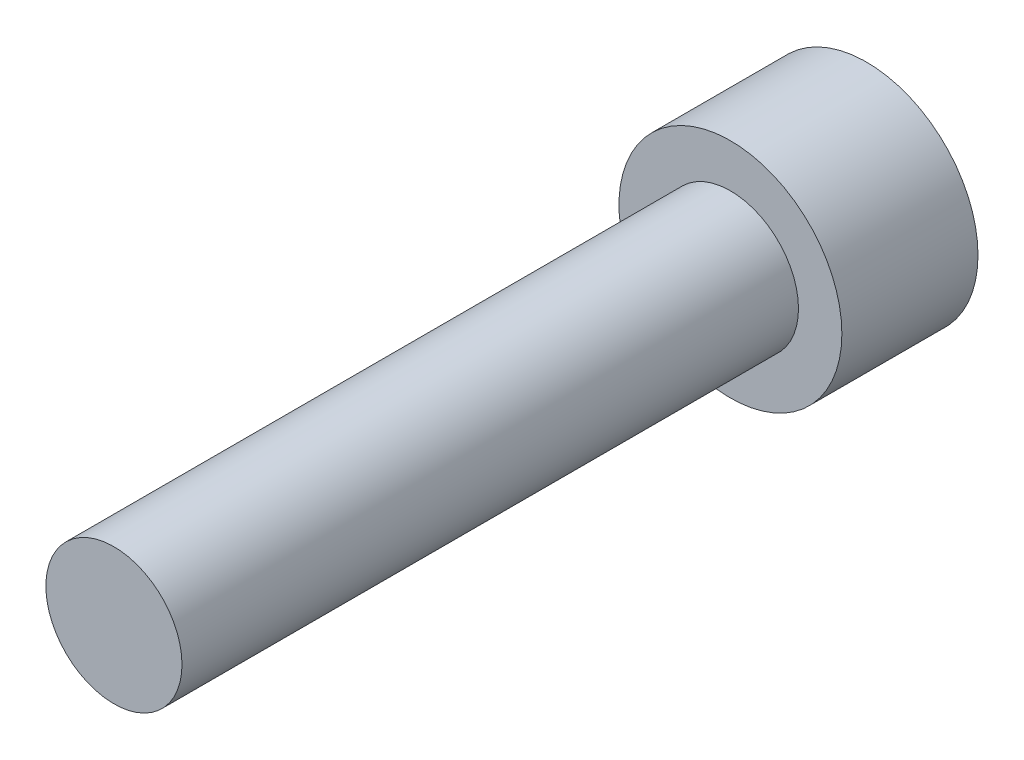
ISO-10303-21;
HEADER;
FILE_DESCRIPTION(('STEP AP214'),'2;1');
FILE_NAME('part.step','',(''),(''),'','','');
FILE_SCHEMA(('AUTOMOTIVE_DESIGN { 1 0 10303 214 1 1 1 1 }'));
ENDSEC;
DATA;
#1=APPLICATION_CONTEXT('core data for automotive mechanical design processes');
#2=APPLICATION_PROTOCOL_DEFINITION('international standard','automotive_design',2000,#1);
#3=PRODUCT_CONTEXT('',#1,'mechanical');
#4=PRODUCT('Part','Part','',(#3));
#5=PRODUCT_RELATED_PRODUCT_CATEGORY('part','',(#4));
#6=PRODUCT_DEFINITION_FORMATION('','',#4);
#7=PRODUCT_DEFINITION_CONTEXT('part definition',#1,'design');
#8=PRODUCT_DEFINITION('design','',#6,#7);
#9=PRODUCT_DEFINITION_SHAPE('','',#8);
#10=(LENGTH_UNIT() NAMED_UNIT(*) SI_UNIT(.MILLI.,.METRE.));
#11=(NAMED_UNIT(*) PLANE_ANGLE_UNIT() SI_UNIT($,.RADIAN.));
#12=(NAMED_UNIT(*) SI_UNIT($,.STERADIAN.) SOLID_ANGLE_UNIT());
#13=UNCERTAINTY_MEASURE_WITH_UNIT(LENGTH_MEASURE(1.E-05),#10,'distance_accuracy_value','');
#14=(GEOMETRIC_REPRESENTATION_CONTEXT(3) GLOBAL_UNCERTAINTY_ASSIGNED_CONTEXT((#13)) GLOBAL_UNIT_ASSIGNED_CONTEXT((#10,
#11,#12)) REPRESENTATION_CONTEXT('',''));
#15=CARTESIAN_POINT('',(0.,0.,0.));
#16=DIRECTION('',(0.,0.,1.));
#17=DIRECTION('',(1.,0.,0.));
#18=AXIS2_PLACEMENT_3D('',#15,#16,#17);
#19=CARTESIAN_POINT('',(0.,-2.8702,-3.5052));
#20=DIRECTION('',(0.,0.,-1.));
#21=DIRECTION('',(-1.,0.,0.));
#22=AXIS2_PLACEMENT_3D('',#19,#20,#21);
#23=PLANE('',#22);
#24=DIRECTION('',(0.866025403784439,-0.5,0.));
#25=VECTOR('',#24,1.);
#26=CARTESIAN_POINT('',(0.,1.5984519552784,-3.5052));
#27=LINE('',#26,#25);
#28=CARTESIAN_POINT('',(0.,1.5984519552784,-3.5052));
#29=VERTEX_POINT('',#28);
#30=CARTESIAN_POINT('',(1.3843,0.799225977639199,-3.5052));
#31=VERTEX_POINT('',#30);
#32=EDGE_CURVE('E46',#29,#31,#27,.T.);
#33=ORIENTED_EDGE('',*,*,#32,.F.);
#34=DIRECTION('',(0.866025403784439,0.5,0.));
#35=VECTOR('',#34,1.);
#36=CARTESIAN_POINT('',(-1.3843,0.7992259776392,-3.5052));
#37=LINE('',#36,#35);
#38=CARTESIAN_POINT('',(-1.3843,0.7992259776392,-3.5052));
#39=VERTEX_POINT('',#38);
#40=EDGE_CURVE('E129',#39,#29,#37,.T.);
#41=ORIENTED_EDGE('',*,*,#40,.F.);
#42=DIRECTION('',(0.,1.,0.));
#43=VECTOR('',#42,1.);
#44=CARTESIAN_POINT('',(-1.3843,-0.799225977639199,-3.5052));
#45=LINE('',#44,#43);
#46=CARTESIAN_POINT('',(-1.3843,-0.799225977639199,-3.5052));
#47=VERTEX_POINT('',#46);
#48=EDGE_CURVE('E127',#47,#39,#45,.T.);
#49=ORIENTED_EDGE('',*,*,#48,.F.);
#50=DIRECTION('',(-0.866025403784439,0.5,0.));
#51=VECTOR('',#50,1.);
#52=CARTESIAN_POINT('',(0.,-1.5984519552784,-3.5052));
#53=LINE('',#52,#51);
#54=CARTESIAN_POINT('',(0.,-1.5984519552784,-3.5052));
#55=VERTEX_POINT('',#54);
#56=EDGE_CURVE('E94',#55,#47,#53,.T.);
#57=ORIENTED_EDGE('',*,*,#56,.F.);
#58=DIRECTION('',(-0.866025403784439,-0.5,0.));
#59=VECTOR('',#58,1.);
#60=CARTESIAN_POINT('',(1.3843,-0.799225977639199,-3.5052));
#61=LINE('',#60,#59);
#62=CARTESIAN_POINT('',(1.3843,-0.799225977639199,-3.5052));
#63=VERTEX_POINT('',#62);
#64=EDGE_CURVE('E123',#63,#55,#61,.T.);
#65=ORIENTED_EDGE('',*,*,#64,.F.);
#66=DIRECTION('',(0.,-1.,0.));
#67=VECTOR('',#66,1.);
#68=CARTESIAN_POINT('',(1.3843,0.799225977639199,-3.5052));
#69=LINE('',#68,#67);
#70=EDGE_CURVE('E120',#31,#63,#69,.T.);
#71=ORIENTED_EDGE('',*,*,#70,.F.);
#72=EDGE_LOOP('',(#33,#41,#49,#57,#65,#71));
#73=FACE_BOUND('',#72,.T.);
#74=CARTESIAN_POINT('',(0.,0.,-3.5052));
#75=DIRECTION('',(0.,0.,1.));
#76=DIRECTION('',(1.,0.,0.));
#77=AXIS2_PLACEMENT_3D('',#74,#75,#76);
#78=CIRCLE('',#77,2.8702);
#79=CARTESIAN_POINT('',(2.8702,0.,-3.5052));
#80=VERTEX_POINT('',#79);
#81=EDGE_CURVE('E11',#80,#80,#78,.T.);
#82=ORIENTED_EDGE('',*,*,#81,.F.);
#83=EDGE_LOOP('',(#82));
#84=FACE_BOUND('',#83,.T.);
#85=ADVANCED_FACE('F32',(#73,#84),#23,.T.);
#86=CARTESIAN_POINT('',(0.,0.,15.875));
#87=DIRECTION('',(0.,0.,1.));
#88=DIRECTION('',(1.,0.,0.));
#89=AXIS2_PLACEMENT_3D('',#86,#87,#88);
#90=CYLINDRICAL_SURFACE('',#89,2.8702);
#91=ORIENTED_EDGE('',*,*,#81,.T.);
#92=EDGE_LOOP('',(#91));
#93=FACE_BOUND('',#92,.T.);
#94=CARTESIAN_POINT('',(0.,0.,0.));
#95=DIRECTION('',(0.,0.,1.));
#96=DIRECTION('',(1.,0.,0.));
#97=AXIS2_PLACEMENT_3D('',#94,#95,#96);
#98=CIRCLE('',#97,2.8702);
#99=CARTESIAN_POINT('',(2.8702,0.,0.));
#100=VERTEX_POINT('',#99);
#101=EDGE_CURVE('E39',#100,#100,#98,.T.);
#102=ORIENTED_EDGE('',*,*,#101,.F.);
#103=EDGE_LOOP('',(#102));
#104=FACE_BOUND('',#103,.T.);
#105=ADVANCED_FACE('F149',(#93,#104),#90,.T.);
#106=CARTESIAN_POINT('',(0.,-1.7526,0.));
#107=DIRECTION('',(0.,0.,1.));
#108=DIRECTION('',(1.,0.,0.));
#109=AXIS2_PLACEMENT_3D('',#106,#107,#108);
#110=PLANE('',#109);
#111=ORIENTED_EDGE('',*,*,#101,.T.);
#112=EDGE_LOOP('',(#111));
#113=FACE_BOUND('',#112,.T.);
#114=CARTESIAN_POINT('',(0.,0.,0.));
#115=DIRECTION('',(0.,0.,1.));
#116=DIRECTION('',(1.,0.,0.));
#117=AXIS2_PLACEMENT_3D('',#114,#115,#116);
#118=CIRCLE('',#117,1.7526);
#119=CARTESIAN_POINT('',(1.7526,0.,0.));
#120=VERTEX_POINT('',#119);
#121=EDGE_CURVE('E141',#120,#120,#118,.T.);
#122=ORIENTED_EDGE('',*,*,#121,.F.);
#123=EDGE_LOOP('',(#122));
#124=FACE_BOUND('',#123,.T.);
#125=ADVANCED_FACE('F146',(#113,#124),#110,.T.);
#126=CARTESIAN_POINT('',(0.,0.,15.875));
#127=DIRECTION('',(0.,0.,1.));
#128=DIRECTION('',(1.,0.,0.));
#129=AXIS2_PLACEMENT_3D('',#126,#127,#128);
#130=CYLINDRICAL_SURFACE('',#129,1.7526);
#131=ORIENTED_EDGE('',*,*,#121,.T.);
#132=EDGE_LOOP('',(#131));
#133=FACE_BOUND('',#132,.T.);
#134=CARTESIAN_POINT('',(0.,0.,15.875));
#135=DIRECTION('',(0.,0.,1.));
#136=DIRECTION('',(1.,0.,0.));
#137=AXIS2_PLACEMENT_3D('',#134,#135,#136);
#138=CIRCLE('',#137,1.7526);
#139=CARTESIAN_POINT('',(1.7526,0.,15.875));
#140=VERTEX_POINT('',#139);
#141=EDGE_CURVE('E133',#140,#140,#138,.T.);
#142=ORIENTED_EDGE('',*,*,#141,.F.);
#143=EDGE_LOOP('',(#142));
#144=FACE_BOUND('',#143,.T.);
#145=ADVANCED_FACE('F156',(#133,#144),#130,.T.);
#146=CARTESIAN_POINT('',(0.,0.,15.875));
#147=DIRECTION('',(0.,0.,1.));
#148=DIRECTION('',(1.,0.,0.));
#149=AXIS2_PLACEMENT_3D('',#146,#147,#148);
#150=PLANE('',#149);
#151=ORIENTED_EDGE('',*,*,#141,.T.);
#152=EDGE_LOOP('',(#151));
#153=FACE_BOUND('',#152,.T.);
#154=ADVANCED_FACE('F162',(#153),#150,.T.);
#155=CARTESIAN_POINT('',(0.,1.5984519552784,-1.4732));
#156=DIRECTION('',(0.5,0.866025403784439,0.));
#157=DIRECTION('',(-0.866025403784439,0.5,0.));
#158=AXIS2_PLACEMENT_3D('',#155,#156,#157);
#159=PLANE('',#158);
#160=ORIENTED_EDGE('',*,*,#32,.T.);
#161=DIRECTION('',(0.,0.,-1.));
#162=VECTOR('',#161,1.);
#163=CARTESIAN_POINT('',(1.3843,0.799225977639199,-1.4732));
#164=LINE('',#163,#162);
#165=CARTESIAN_POINT('',(1.3843,0.799225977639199,-1.4732));
#166=VERTEX_POINT('',#165);
#167=EDGE_CURVE('E76',#166,#31,#164,.T.);
#168=ORIENTED_EDGE('',*,*,#167,.F.);
#169=DIRECTION('',(0.866025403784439,-0.5,0.));
#170=VECTOR('',#169,1.);
#171=CARTESIAN_POINT('',(0.,1.5984519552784,-1.4732));
#172=LINE('',#171,#170);
#173=CARTESIAN_POINT('',(0.,1.5984519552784,-1.4732));
#174=VERTEX_POINT('',#173);
#175=EDGE_CURVE('E131',#174,#166,#172,.T.);
#176=ORIENTED_EDGE('',*,*,#175,.F.);
#177=DIRECTION('',(0.,0.,-1.));
#178=VECTOR('',#177,1.);
#179=CARTESIAN_POINT('',(0.,1.5984519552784,-1.4732));
#180=LINE('',#179,#178);
#181=EDGE_CURVE('E54',#174,#29,#180,.T.);
#182=ORIENTED_EDGE('',*,*,#181,.T.);
#183=EDGE_LOOP('',(#160,#168,#176,#182));
#184=FACE_BOUND('',#183,.T.);
#185=ADVANCED_FACE('F166',(#184),#159,.F.);
#186=CARTESIAN_POINT('',(-1.3843,0.7992259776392,-1.4732));
#187=DIRECTION('',(-0.5,0.866025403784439,0.));
#188=DIRECTION('',(-0.866025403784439,-0.5,0.));
#189=AXIS2_PLACEMENT_3D('',#186,#187,#188);
#190=PLANE('',#189);
#191=ORIENTED_EDGE('',*,*,#40,.T.);
#192=ORIENTED_EDGE('',*,*,#181,.F.);
#193=DIRECTION('',(0.866025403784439,0.5,0.));
#194=VECTOR('',#193,1.);
#195=CARTESIAN_POINT('',(-1.3843,0.7992259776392,-1.4732));
#196=LINE('',#195,#194);
#197=CARTESIAN_POINT('',(-1.3843,0.7992259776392,-1.4732));
#198=VERTEX_POINT('',#197);
#199=EDGE_CURVE('E106',#198,#174,#196,.T.);
#200=ORIENTED_EDGE('',*,*,#199,.F.);
#201=DIRECTION('',(0.,0.,-1.));
#202=VECTOR('',#201,1.);
#203=CARTESIAN_POINT('',(-1.3843,0.7992259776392,-1.4732));
#204=LINE('',#203,#202);
#205=EDGE_CURVE('E98',#198,#39,#204,.T.);
#206=ORIENTED_EDGE('',*,*,#205,.T.);
#207=EDGE_LOOP('',(#191,#192,#200,#206));
#208=FACE_BOUND('',#207,.T.);
#209=ADVANCED_FACE('F170',(#208),#190,.F.);
#210=CARTESIAN_POINT('',(-1.3843,-0.799225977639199,-1.4732));
#211=DIRECTION('',(-1.,0.,0.));
#212=DIRECTION('',(0.,0.,1.));
#213=AXIS2_PLACEMENT_3D('',#210,#211,#212);
#214=PLANE('',#213);
#215=ORIENTED_EDGE('',*,*,#48,.T.);
#216=ORIENTED_EDGE('',*,*,#205,.F.);
#217=DIRECTION('',(0.,1.,0.));
#218=VECTOR('',#217,1.);
#219=CARTESIAN_POINT('',(-1.3843,-0.799225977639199,-1.4732));
#220=LINE('',#219,#218);
#221=CARTESIAN_POINT('',(-1.3843,-0.799225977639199,-1.4732));
#222=VERTEX_POINT('',#221);
#223=EDGE_CURVE('E102',#222,#198,#220,.T.);
#224=ORIENTED_EDGE('',*,*,#223,.F.);
#225=DIRECTION('',(0.,0.,-1.));
#226=VECTOR('',#225,1.);
#227=CARTESIAN_POINT('',(-1.3843,-0.799225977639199,-1.4732));
#228=LINE('',#227,#226);
#229=EDGE_CURVE('E87',#222,#47,#228,.T.);
#230=ORIENTED_EDGE('',*,*,#229,.T.);
#231=EDGE_LOOP('',(#215,#216,#224,#230));
#232=FACE_BOUND('',#231,.T.);
#233=ADVANCED_FACE('F103',(#232),#214,.F.);
#234=CARTESIAN_POINT('',(0.,-1.5984519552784,-1.4732));
#235=DIRECTION('',(-0.5,-0.866025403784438,0.));
#236=DIRECTION('',(0.866025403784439,-0.5,0.));
#237=AXIS2_PLACEMENT_3D('',#234,#235,#236);
#238=PLANE('',#237);
#239=ORIENTED_EDGE('',*,*,#56,.T.);
#240=ORIENTED_EDGE('',*,*,#229,.F.);
#241=DIRECTION('',(-0.866025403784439,0.5,0.));
#242=VECTOR('',#241,1.);
#243=CARTESIAN_POINT('',(0.,-1.5984519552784,-1.4732));
#244=LINE('',#243,#242);
#245=CARTESIAN_POINT('',(0.,-1.5984519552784,-1.4732));
#246=VERTEX_POINT('',#245);
#247=EDGE_CURVE('E91',#246,#222,#244,.T.);
#248=ORIENTED_EDGE('',*,*,#247,.F.);
#249=DIRECTION('',(0.,0.,-1.));
#250=VECTOR('',#249,1.);
#251=CARTESIAN_POINT('',(0.,-1.5984519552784,-1.4732));
#252=LINE('',#251,#250);
#253=EDGE_CURVE('E99',#246,#55,#252,.T.);
#254=ORIENTED_EDGE('',*,*,#253,.T.);
#255=EDGE_LOOP('',(#239,#240,#248,#254));
#256=FACE_BOUND('',#255,.T.);
#257=ADVANCED_FACE('F89',(#256),#238,.F.);
#258=CARTESIAN_POINT('',(1.3843,-0.799225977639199,-1.4732));
#259=DIRECTION('',(0.5,-0.866025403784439,0.));
#260=DIRECTION('',(0.866025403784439,0.5,0.));
#261=AXIS2_PLACEMENT_3D('',#258,#259,#260);
#262=PLANE('',#261);
#263=ORIENTED_EDGE('',*,*,#64,.T.);
#264=ORIENTED_EDGE('',*,*,#253,.F.);
#265=DIRECTION('',(-0.866025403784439,-0.5,0.));
#266=VECTOR('',#265,1.);
#267=CARTESIAN_POINT('',(1.3843,-0.799225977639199,-1.4732));
#268=LINE('',#267,#266);
#269=CARTESIAN_POINT('',(1.3843,-0.799225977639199,-1.4732));
#270=VERTEX_POINT('',#269);
#271=EDGE_CURVE('E112',#270,#246,#268,.T.);
#272=ORIENTED_EDGE('',*,*,#271,.F.);
#273=DIRECTION('',(0.,0.,-1.));
#274=VECTOR('',#273,1.);
#275=CARTESIAN_POINT('',(1.3843,-0.799225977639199,-1.4732));
#276=LINE('',#275,#274);
#277=EDGE_CURVE('E136',#270,#63,#276,.T.);
#278=ORIENTED_EDGE('',*,*,#277,.T.);
#279=EDGE_LOOP('',(#263,#264,#272,#278));
#280=FACE_BOUND('',#279,.T.);
#281=ADVANCED_FACE('F174',(#280),#262,.F.);
#282=CARTESIAN_POINT('',(1.3843,0.799225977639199,-1.4732));
#283=DIRECTION('',(1.,0.,0.));
#284=DIRECTION('',(0.,1.,0.));
#285=AXIS2_PLACEMENT_3D('',#282,#283,#284);
#286=PLANE('',#285);
#287=ORIENTED_EDGE('',*,*,#70,.T.);
#288=ORIENTED_EDGE('',*,*,#277,.F.);
#289=DIRECTION('',(0.,-1.,0.));
#290=VECTOR('',#289,1.);
#291=CARTESIAN_POINT('',(1.3843,0.799225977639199,-1.4732));
#292=LINE('',#291,#290);
#293=EDGE_CURVE('E114',#166,#270,#292,.T.);
#294=ORIENTED_EDGE('',*,*,#293,.F.);
#295=ORIENTED_EDGE('',*,*,#167,.T.);
#296=EDGE_LOOP('',(#287,#288,#294,#295));
#297=FACE_BOUND('',#296,.T.);
#298=ADVANCED_FACE('F171',(#297),#286,.F.);
#299=CARTESIAN_POINT('',(1.3843,0.799225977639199,-1.4732));
#300=DIRECTION('',(0.,0.,-1.));
#301=DIRECTION('',(-1.,0.,0.));
#302=AXIS2_PLACEMENT_3D('',#299,#300,#301);
#303=PLANE('',#302);
#304=ORIENTED_EDGE('',*,*,#175,.T.);
#305=ORIENTED_EDGE('',*,*,#293,.T.);
#306=ORIENTED_EDGE('',*,*,#271,.T.);
#307=ORIENTED_EDGE('',*,*,#247,.T.);
#308=ORIENTED_EDGE('',*,*,#223,.T.);
#309=ORIENTED_EDGE('',*,*,#199,.T.);
#310=EDGE_LOOP('',(#304,#305,#306,#307,#308,#309));
#311=FACE_BOUND('',#310,.T.);
#312=ADVANCED_FACE('F109',(#311),#303,.T.);
#313=CLOSED_SHELL('',(#85,#105,#125,#145,#154,#185,#209,#233,#257,#281,#298,#312));
#314=MANIFOLD_SOLID_BREP('B2',#313);
#315=ADVANCED_BREP_SHAPE_REPRESENTATION('',(#18,#314),#14);
#316=SHAPE_DEFINITION_REPRESENTATION(#9,#315);
ENDSEC;
END-ISO-10303-21;
